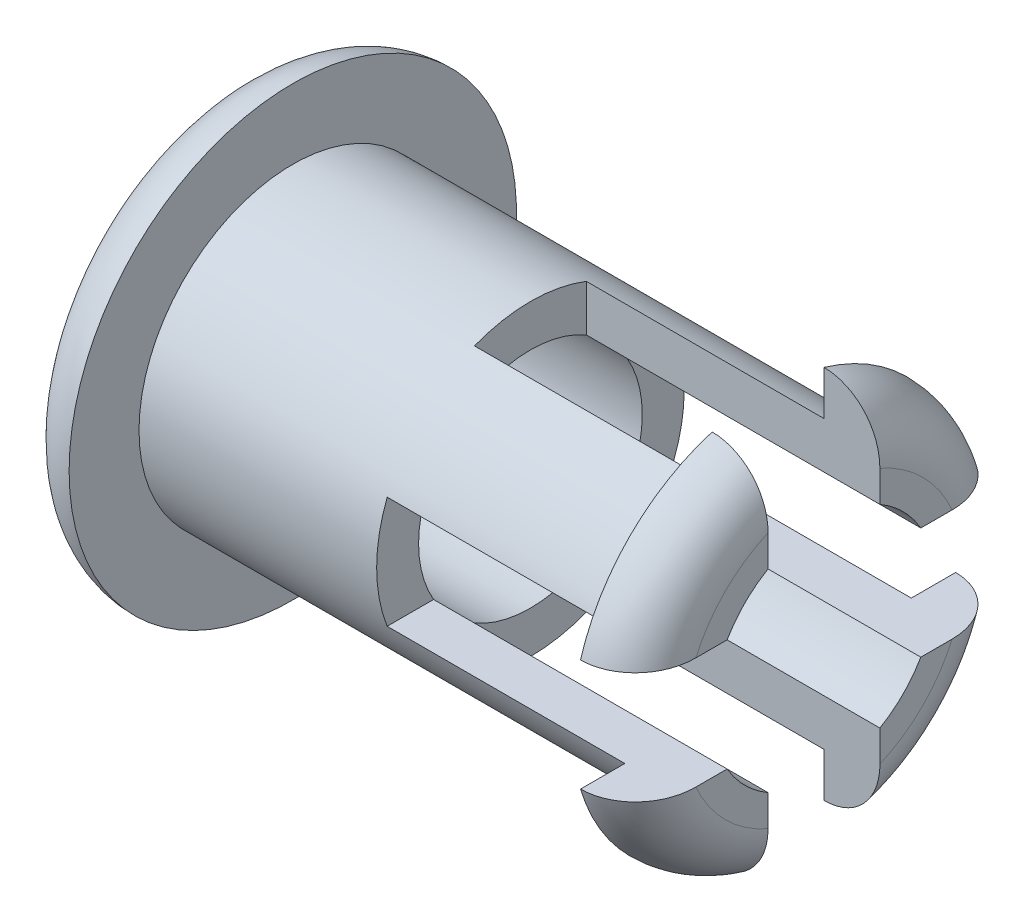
ISO-10303-21;
HEADER;
FILE_DESCRIPTION(('STEP AP214'),'2;1');
FILE_NAME('part.step','',(''),(''),'','','');
FILE_SCHEMA(('AUTOMOTIVE_DESIGN { 1 0 10303 214 1 1 1 1 }'));
ENDSEC;
DATA;
#1=APPLICATION_CONTEXT('core data for automotive mechanical design processes');
#2=APPLICATION_PROTOCOL_DEFINITION('international standard','automotive_design',2000,#1);
#3=PRODUCT_CONTEXT('',#1,'mechanical');
#4=PRODUCT('Part','Part','',(#3));
#5=PRODUCT_RELATED_PRODUCT_CATEGORY('part','',(#4));
#6=PRODUCT_DEFINITION_FORMATION('','',#4);
#7=PRODUCT_DEFINITION_CONTEXT('part definition',#1,'design');
#8=PRODUCT_DEFINITION('design','',#6,#7);
#9=PRODUCT_DEFINITION_SHAPE('','',#8);
#10=(LENGTH_UNIT() NAMED_UNIT(*) SI_UNIT(.MILLI.,.METRE.));
#11=(NAMED_UNIT(*) PLANE_ANGLE_UNIT() SI_UNIT($,.RADIAN.));
#12=(NAMED_UNIT(*) SI_UNIT($,.STERADIAN.) SOLID_ANGLE_UNIT());
#13=UNCERTAINTY_MEASURE_WITH_UNIT(LENGTH_MEASURE(1.E-05),#10,'distance_accuracy_value','');
#14=(GEOMETRIC_REPRESENTATION_CONTEXT(3) GLOBAL_UNCERTAINTY_ASSIGNED_CONTEXT((#13)) GLOBAL_UNIT_ASSIGNED_CONTEXT((#10,
#11,#12)) REPRESENTATION_CONTEXT('',''));
#15=CARTESIAN_POINT('',(0.,0.,0.));
#16=DIRECTION('',(0.,0.,1.));
#17=DIRECTION('',(1.,0.,0.));
#18=AXIS2_PLACEMENT_3D('',#15,#16,#17);
#19=CARTESIAN_POINT('',(16.66875,0.,0.));
#20=DIRECTION('',(1.,0.,0.));
#21=DIRECTION('',(0.,0.,-1.));
#22=AXIS2_PLACEMENT_3D('',#19,#20,#21);
#23=PLANE('',#22);
#24=DIRECTION('',(0.,0.,1.));
#25=VECTOR('',#24,1.);
#26=CARTESIAN_POINT('',(16.66875,3.175,-12.7));
#27=LINE('',#26,#25);
#28=CARTESIAN_POINT('',(16.66875,3.175,-7.2748389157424));
#29=VERTEX_POINT('',#28);
#30=CARTESIAN_POINT('',(16.66875,3.175,-5.49926131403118));
#31=VERTEX_POINT('',#30);
#32=EDGE_CURVE('E396',#29,#31,#27,.T.);
#33=ORIENTED_EDGE('',*,*,#32,.F.);
#34=CARTESIAN_POINT('',(16.66875,0.,0.));
#35=DIRECTION('',(1.,0.,0.));
#36=DIRECTION('',(0.,0.,-1.));
#37=AXIS2_PLACEMENT_3D('',#34,#35,#36);
#38=CIRCLE('',#37,7.9375);
#39=CARTESIAN_POINT('',(16.66875,7.2748389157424,-3.175));
#40=VERTEX_POINT('',#39);
#41=EDGE_CURVE('E367',#29,#40,#38,.T.);
#42=ORIENTED_EDGE('',*,*,#41,.T.);
#43=DIRECTION('',(0.,1.,0.));
#44=VECTOR('',#43,1.);
#45=CARTESIAN_POINT('',(16.66875,-12.7,-3.175));
#46=LINE('',#45,#44);
#47=CARTESIAN_POINT('',(16.66875,5.49926131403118,-3.175));
#48=VERTEX_POINT('',#47);
#49=EDGE_CURVE('E208',#48,#40,#46,.T.);
#50=ORIENTED_EDGE('',*,*,#49,.F.);
#51=CARTESIAN_POINT('',(16.66875,0.,0.));
#52=DIRECTION('',(-1.,0.,0.));
#53=DIRECTION('',(0.,0.,1.));
#54=AXIS2_PLACEMENT_3D('',#51,#52,#53);
#55=CIRCLE('',#54,6.35);
#56=EDGE_CURVE('E231',#48,#31,#55,.T.);
#57=ORIENTED_EDGE('',*,*,#56,.T.);
#58=EDGE_LOOP('',(#33,#42,#50,#57));
#59=FACE_BOUND('',#58,.T.);
#60=ADVANCED_FACE('F33',(#59),#23,.T.);
#61=CARTESIAN_POINT('',(13.49375,0.,0.));
#62=DIRECTION('',(1.,0.,0.));
#63=DIRECTION('',(0.,0.,-1.));
#64=AXIS2_PLACEMENT_3D('',#61,#62,#63);
#65=PLANE('',#64);
#66=CARTESIAN_POINT('',(13.49375,0.,0.));
#67=DIRECTION('',(1.,0.,0.));
#68=DIRECTION('',(0.,0.,-1.));
#69=AXIS2_PLACEMENT_3D('',#66,#67,#68);
#70=CIRCLE('',#69,8.73125);
#71=CARTESIAN_POINT('',(13.49375,3.175,-8.13351717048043));
#72=VERTEX_POINT('',#71);
#73=CARTESIAN_POINT('',(13.49375,8.13351717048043,-3.175));
#74=VERTEX_POINT('',#73);
#75=EDGE_CURVE('E269',#72,#74,#70,.T.);
#76=ORIENTED_EDGE('',*,*,#75,.T.);
#77=DIRECTION('',(0.,1.,0.));
#78=VECTOR('',#77,1.);
#79=CARTESIAN_POINT('',(13.49375,0.,-3.175));
#80=LINE('',#79,#78);
#81=CARTESIAN_POINT('',(13.49375,10.6492737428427,-3.175));
#82=VERTEX_POINT('',#81);
#83=EDGE_CURVE('E375',#74,#82,#80,.T.);
#84=ORIENTED_EDGE('',*,*,#83,.T.);
#85=CARTESIAN_POINT('',(13.49375,0.,0.));
#86=DIRECTION('',(1.,0.,0.));
#87=DIRECTION('',(0.,0.,-1.));
#88=AXIS2_PLACEMENT_3D('',#85,#86,#87);
#89=CIRCLE('',#88,11.1125);
#90=CARTESIAN_POINT('',(13.49375,3.175,-10.6492737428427));
#91=VERTEX_POINT('',#90);
#92=EDGE_CURVE('E253',#91,#82,#89,.T.);
#93=ORIENTED_EDGE('',*,*,#92,.F.);
#94=DIRECTION('',(0.,0.,1.));
#95=VECTOR('',#94,1.);
#96=CARTESIAN_POINT('',(13.49375,3.175,0.));
#97=LINE('',#96,#95);
#98=EDGE_CURVE('E421',#91,#72,#97,.T.);
#99=ORIENTED_EDGE('',*,*,#98,.T.);
#100=EDGE_LOOP('',(#76,#84,#93,#99));
#101=FACE_BOUND('',#100,.T.);
#102=ADVANCED_FACE('F379',(#101),#65,.F.);
#103=CARTESIAN_POINT('',(16.66875,-7.2748389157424,-3.175));
#104=VERTEX_POINT('',#103);
#105=CARTESIAN_POINT('',(16.66875,-5.49926131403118,-3.175));
#106=VERTEX_POINT('',#105);
#107=EDGE_CURVE('E500',#104,#106,#46,.T.);
#108=ORIENTED_EDGE('',*,*,#107,.F.);
#109=CARTESIAN_POINT('',(16.66875,0.,0.));
#110=DIRECTION('',(1.,0.,0.));
#111=DIRECTION('',(0.,0.,-1.));
#112=AXIS2_PLACEMENT_3D('',#109,#110,#111);
#113=CIRCLE('',#112,7.9375);
#114=CARTESIAN_POINT('',(16.66875,-3.175,-7.2748389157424));
#115=VERTEX_POINT('',#114);
#116=EDGE_CURVE('E340',#104,#115,#113,.T.);
#117=ORIENTED_EDGE('',*,*,#116,.T.);
#118=DIRECTION('',(0.,0.,1.));
#119=VECTOR('',#118,1.);
#120=CARTESIAN_POINT('',(16.66875,-3.175,-12.7));
#121=LINE('',#120,#119);
#122=CARTESIAN_POINT('',(16.66875,-3.175,-5.49926131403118));
#123=VERTEX_POINT('',#122);
#124=EDGE_CURVE('E400',#115,#123,#121,.T.);
#125=ORIENTED_EDGE('',*,*,#124,.T.);
#126=EDGE_CURVE('E228',#123,#106,#55,.T.);
#127=ORIENTED_EDGE('',*,*,#126,.T.);
#128=EDGE_LOOP('',(#108,#117,#125,#127));
#129=FACE_BOUND('',#128,.T.);
#130=ADVANCED_FACE('F498',(#129),#23,.T.);
#131=CARTESIAN_POINT('',(13.49375,-10.6492737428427,-3.175));
#132=VERTEX_POINT('',#131);
#133=CARTESIAN_POINT('',(13.49375,-3.175,-10.6492737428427));
#134=VERTEX_POINT('',#133);
#135=EDGE_CURVE('E240',#132,#134,#89,.T.);
#136=ORIENTED_EDGE('',*,*,#135,.F.);
#137=DIRECTION('',(0.,1.,0.));
#138=VECTOR('',#137,1.);
#139=CARTESIAN_POINT('',(13.49375,0.,-3.175));
#140=LINE('',#139,#138);
#141=CARTESIAN_POINT('',(13.49375,-8.13351717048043,-3.175));
#142=VERTEX_POINT('',#141);
#143=EDGE_CURVE('E450',#132,#142,#140,.T.);
#144=ORIENTED_EDGE('',*,*,#143,.T.);
#145=CARTESIAN_POINT('',(13.49375,-3.175,-8.13351717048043));
#146=VERTEX_POINT('',#145);
#147=EDGE_CURVE('E266',#142,#146,#70,.T.);
#148=ORIENTED_EDGE('',*,*,#147,.T.);
#149=DIRECTION('',(0.,0.,-1.));
#150=VECTOR('',#149,1.);
#151=CARTESIAN_POINT('',(13.49375,-3.175,0.));
#152=LINE('',#151,#150);
#153=EDGE_CURVE('E407',#146,#134,#152,.T.);
#154=ORIENTED_EDGE('',*,*,#153,.T.);
#155=EDGE_LOOP('',(#136,#144,#148,#154));
#156=FACE_BOUND('',#155,.T.);
#157=ADVANCED_FACE('F448',(#156),#65,.F.);
#158=DIRECTION('',(0.,1.,0.));
#159=VECTOR('',#158,1.);
#160=CARTESIAN_POINT('',(16.66875,-12.7,3.175));
#161=LINE('',#160,#159);
#162=CARTESIAN_POINT('',(16.66875,5.49926131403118,3.175));
#163=VERTEX_POINT('',#162);
#164=CARTESIAN_POINT('',(16.66875,7.2748389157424,3.175));
#165=VERTEX_POINT('',#164);
#166=EDGE_CURVE('E209',#163,#165,#161,.T.);
#167=ORIENTED_EDGE('',*,*,#166,.T.);
#168=CARTESIAN_POINT('',(16.66875,0.,0.));
#169=DIRECTION('',(1.,0.,0.));
#170=DIRECTION('',(0.,0.,-1.));
#171=AXIS2_PLACEMENT_3D('',#168,#169,#170);
#172=CIRCLE('',#171,7.9375);
#173=CARTESIAN_POINT('',(16.66875,3.175,7.2748389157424));
#174=VERTEX_POINT('',#173);
#175=EDGE_CURVE('E465',#165,#174,#172,.T.);
#176=ORIENTED_EDGE('',*,*,#175,.T.);
#177=CARTESIAN_POINT('',(16.66875,3.175,5.49926131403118));
#178=VERTEX_POINT('',#177);
#179=EDGE_CURVE('E397',#178,#174,#27,.T.);
#180=ORIENTED_EDGE('',*,*,#179,.F.);
#181=EDGE_CURVE('E232',#178,#163,#55,.T.);
#182=ORIENTED_EDGE('',*,*,#181,.T.);
#183=EDGE_LOOP('',(#167,#176,#180,#182));
#184=FACE_BOUND('',#183,.T.);
#185=ADVANCED_FACE('F509',(#184),#23,.T.);
#186=CARTESIAN_POINT('',(13.49375,10.6492737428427,3.175));
#187=VERTEX_POINT('',#186);
#188=CARTESIAN_POINT('',(13.49375,3.175,10.6492737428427));
#189=VERTEX_POINT('',#188);
#190=EDGE_CURVE('E248',#187,#189,#89,.T.);
#191=ORIENTED_EDGE('',*,*,#190,.F.);
#192=DIRECTION('',(0.,-1.,0.));
#193=VECTOR('',#192,1.);
#194=CARTESIAN_POINT('',(13.49375,0.,3.175));
#195=LINE('',#194,#193);
#196=CARTESIAN_POINT('',(13.49375,8.13351717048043,3.175));
#197=VERTEX_POINT('',#196);
#198=EDGE_CURVE('E458',#187,#197,#195,.T.);
#199=ORIENTED_EDGE('',*,*,#198,.T.);
#200=CARTESIAN_POINT('',(13.49375,3.175,8.13351717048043));
#201=VERTEX_POINT('',#200);
#202=EDGE_CURVE('E272',#197,#201,#70,.T.);
#203=ORIENTED_EDGE('',*,*,#202,.T.);
#204=EDGE_CURVE('E417',#201,#189,#97,.T.);
#205=ORIENTED_EDGE('',*,*,#204,.T.);
#206=EDGE_LOOP('',(#191,#199,#203,#205));
#207=FACE_BOUND('',#206,.T.);
#208=ADVANCED_FACE('F457',(#207),#65,.F.);
#209=CARTESIAN_POINT('',(13.49375,0.,0.));
#210=DIRECTION('',(-1.,0.,0.));
#211=DIRECTION('',(0.,0.,1.));
#212=AXIS2_PLACEMENT_3D('',#209,#210,#211);
#213=CYLINDRICAL_SURFACE('',#212,8.73125);
#214=CARTESIAN_POINT('',(0.,0.,0.));
#215=DIRECTION('',(-1.,0.,0.));
#216=DIRECTION('',(0.,0.,1.));
#217=AXIS2_PLACEMENT_3D('',#214,#215,#216);
#218=CIRCLE('',#217,8.73125);
#219=CARTESIAN_POINT('',(0.,8.13351717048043,3.175));
#220=VERTEX_POINT('',#219);
#221=CARTESIAN_POINT('',(0.,8.13351717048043,-3.175));
#222=VERTEX_POINT('',#221);
#223=EDGE_CURVE('E386',#220,#222,#218,.T.);
#224=ORIENTED_EDGE('',*,*,#223,.T.);
#225=DIRECTION('',(-1.,0.,0.));
#226=VECTOR('',#225,1.);
#227=CARTESIAN_POINT('',(13.49375,8.13351717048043,-3.175));
#228=LINE('',#227,#226);
#229=EDGE_CURVE('E383',#222,#74,#228,.F.);
#230=ORIENTED_EDGE('',*,*,#229,.T.);
#231=ORIENTED_EDGE('',*,*,#75,.F.);
#232=DIRECTION('',(-1.,0.,0.));
#233=VECTOR('',#232,1.);
#234=CARTESIAN_POINT('',(13.49375,3.175,-8.13351717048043));
#235=LINE('',#234,#233);
#236=CARTESIAN_POINT('',(0.,3.175,-8.13351717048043));
#237=VERTEX_POINT('',#236);
#238=EDGE_CURVE('E424',#72,#237,#235,.T.);
#239=ORIENTED_EDGE('',*,*,#238,.T.);
#240=CARTESIAN_POINT('',(0.,0.,0.));
#241=DIRECTION('',(-1.,0.,0.));
#242=DIRECTION('',(0.,0.,1.));
#243=AXIS2_PLACEMENT_3D('',#240,#241,#242);
#244=CIRCLE('',#243,8.73125);
#245=CARTESIAN_POINT('',(0.,-3.175,-8.13351717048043));
#246=VERTEX_POINT('',#245);
#247=EDGE_CURVE('E235',#237,#246,#244,.T.);
#248=ORIENTED_EDGE('',*,*,#247,.T.);
#249=DIRECTION('',(-1.,0.,0.));
#250=VECTOR('',#249,1.);
#251=CARTESIAN_POINT('',(13.49375,-3.175,-8.13351717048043));
#252=LINE('',#251,#250);
#253=EDGE_CURVE('E410',#246,#146,#252,.F.);
#254=ORIENTED_EDGE('',*,*,#253,.T.);
#255=ORIENTED_EDGE('',*,*,#147,.F.);
#256=DIRECTION('',(-1.,0.,0.));
#257=VECTOR('',#256,1.);
#258=CARTESIAN_POINT('',(13.49375,-8.13351717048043,-3.175));
#259=LINE('',#258,#257);
#260=CARTESIAN_POINT('',(0.,-8.13351717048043,-3.175));
#261=VERTEX_POINT('',#260);
#262=EDGE_CURVE('E388',#142,#261,#259,.T.);
#263=ORIENTED_EDGE('',*,*,#262,.T.);
#264=CARTESIAN_POINT('',(0.,-8.13351717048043,3.175));
#265=VERTEX_POINT('',#264);
#266=EDGE_CURVE('E382',#261,#265,#218,.T.);
#267=ORIENTED_EDGE('',*,*,#266,.T.);
#268=DIRECTION('',(-1.,0.,0.));
#269=VECTOR('',#268,1.);
#270=CARTESIAN_POINT('',(13.49375,-8.13351717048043,3.175));
#271=LINE('',#270,#269);
#272=CARTESIAN_POINT('',(13.49375,-8.13351717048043,3.175));
#273=VERTEX_POINT('',#272);
#274=EDGE_CURVE('E478',#265,#273,#271,.F.);
#275=ORIENTED_EDGE('',*,*,#274,.T.);
#276=CARTESIAN_POINT('',(13.49375,-3.175,8.13351717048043));
#277=VERTEX_POINT('',#276);
#278=EDGE_CURVE('E273',#277,#273,#70,.T.);
#279=ORIENTED_EDGE('',*,*,#278,.F.);
#280=DIRECTION('',(-1.,0.,0.));
#281=VECTOR('',#280,1.);
#282=CARTESIAN_POINT('',(13.49375,-3.175,8.13351717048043));
#283=LINE('',#282,#281);
#284=CARTESIAN_POINT('',(0.,-3.175,8.13351717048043));
#285=VERTEX_POINT('',#284);
#286=EDGE_CURVE('E414',#277,#285,#283,.T.);
#287=ORIENTED_EDGE('',*,*,#286,.T.);
#288=CARTESIAN_POINT('',(0.,3.175,8.13351717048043));
#289=VERTEX_POINT('',#288);
#290=EDGE_CURVE('E426',#285,#289,#244,.T.);
#291=ORIENTED_EDGE('',*,*,#290,.T.);
#292=DIRECTION('',(-1.,0.,0.));
#293=VECTOR('',#292,1.);
#294=CARTESIAN_POINT('',(13.49375,3.175,8.13351717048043));
#295=LINE('',#294,#293);
#296=EDGE_CURVE('E420',#289,#201,#295,.F.);
#297=ORIENTED_EDGE('',*,*,#296,.T.);
#298=ORIENTED_EDGE('',*,*,#202,.F.);
#299=DIRECTION('',(-1.,0.,0.));
#300=VECTOR('',#299,1.);
#301=CARTESIAN_POINT('',(13.49375,8.13351717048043,3.175));
#302=LINE('',#301,#300);
#303=EDGE_CURVE('E481',#197,#220,#302,.T.);
#304=ORIENTED_EDGE('',*,*,#303,.T.);
#305=EDGE_LOOP('',(#224,#230,#231,#239,#248,#254,#255,#263,#267,#275,#279,#287,#291,#297,#298,#304));
#306=FACE_BOUND('',#305,.T.);
#307=CARTESIAN_POINT('',(-13.49375,0.,0.));
#308=DIRECTION('',(1.,0.,0.));
#309=DIRECTION('',(0.,0.,-1.));
#310=AXIS2_PLACEMENT_3D('',#307,#308,#309);
#311=CIRCLE('',#310,8.73125);
#312=CARTESIAN_POINT('',(-13.49375,0.,-8.73125));
#313=VERTEX_POINT('',#312);
#314=EDGE_CURVE('E262',#313,#313,#311,.T.);
#315=ORIENTED_EDGE('',*,*,#314,.T.);
#316=EDGE_LOOP('',(#315));
#317=FACE_BOUND('',#316,.T.);
#318=ADVANCED_FACE('F431',(#306,#317),#213,.T.);
#319=CARTESIAN_POINT('',(-16.66875,0.,0.));
#320=DIRECTION('',(-1.,0.,0.));
#321=DIRECTION('',(0.,0.,1.));
#322=AXIS2_PLACEMENT_3D('',#319,#320,#321);
#323=PLANE('',#322);
#324=CARTESIAN_POINT('',(-16.66875,0.,0.));
#325=DIRECTION('',(-1.,0.,0.));
#326=DIRECTION('',(0.,0.,1.));
#327=AXIS2_PLACEMENT_3D('',#324,#325,#326);
#328=CIRCLE('',#327,9.525);
#329=CARTESIAN_POINT('',(-16.66875,0.,9.525));
#330=VERTEX_POINT('',#329);
#331=EDGE_CURVE('E298',#330,#330,#328,.T.);
#332=ORIENTED_EDGE('',*,*,#331,.T.);
#333=EDGE_LOOP('',(#332));
#334=FACE_BOUND('',#333,.T.);
#335=CARTESIAN_POINT('',(-16.66875,0.,0.));
#336=DIRECTION('',(-1.,0.,0.));
#337=DIRECTION('',(0.,0.,1.));
#338=AXIS2_PLACEMENT_3D('',#335,#336,#337);
#339=CIRCLE('',#338,6.35);
#340=CARTESIAN_POINT('',(-16.66875,0.,6.35));
#341=VERTEX_POINT('',#340);
#342=EDGE_CURVE('E229',#341,#341,#339,.T.);
#343=ORIENTED_EDGE('',*,*,#342,.F.);
#344=EDGE_LOOP('',(#343));
#345=FACE_BOUND('',#344,.T.);
#346=ADVANCED_FACE('F631',(#334,#345),#323,.T.);
#347=CARTESIAN_POINT('',(-13.49375,0.,0.));
#348=DIRECTION('',(-1.,0.,0.));
#349=DIRECTION('',(0.,0.,1.));
#350=AXIS2_PLACEMENT_3D('',#347,#348,#349);
#351=PLANE('',#350);
#352=ORIENTED_EDGE('',*,*,#314,.F.);
#353=EDGE_LOOP('',(#352));
#354=FACE_BOUND('',#353,.T.);
#355=CARTESIAN_POINT('',(-13.49375,0.,0.));
#356=DIRECTION('',(-1.,0.,0.));
#357=DIRECTION('',(0.,0.,1.));
#358=AXIS2_PLACEMENT_3D('',#355,#356,#357);
#359=CIRCLE('',#358,12.7);
#360=CARTESIAN_POINT('',(-13.49375,0.,12.7));
#361=VERTEX_POINT('',#360);
#362=EDGE_CURVE('E259',#361,#361,#359,.T.);
#363=ORIENTED_EDGE('',*,*,#362,.F.);
#364=EDGE_LOOP('',(#363));
#365=FACE_BOUND('',#364,.T.);
#366=ADVANCED_FACE('F519',(#354,#365),#351,.F.);
#367=CARTESIAN_POINT('',(16.66875,-3.175,5.49926131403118));
#368=VERTEX_POINT('',#367);
#369=CARTESIAN_POINT('',(16.66875,-3.175,7.2748389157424));
#370=VERTEX_POINT('',#369);
#371=EDGE_CURVE('E401',#368,#370,#121,.T.);
#372=ORIENTED_EDGE('',*,*,#371,.T.);
#373=CARTESIAN_POINT('',(16.66875,0.,0.));
#374=DIRECTION('',(1.,0.,0.));
#375=DIRECTION('',(0.,0.,-1.));
#376=AXIS2_PLACEMENT_3D('',#373,#374,#375);
#377=CIRCLE('',#376,7.9375);
#378=CARTESIAN_POINT('',(16.66875,-7.2748389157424,3.175));
#379=VERTEX_POINT('',#378);
#380=EDGE_CURVE('E206',#370,#379,#377,.T.);
#381=ORIENTED_EDGE('',*,*,#380,.T.);
#382=CARTESIAN_POINT('',(16.66875,-5.49926131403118,3.175));
#383=VERTEX_POINT('',#382);
#384=EDGE_CURVE('E198',#379,#383,#161,.T.);
#385=ORIENTED_EDGE('',*,*,#384,.T.);
#386=EDGE_CURVE('E203',#383,#368,#55,.T.);
#387=ORIENTED_EDGE('',*,*,#386,.T.);
#388=EDGE_LOOP('',(#372,#381,#385,#387));
#389=FACE_BOUND('',#388,.T.);
#390=ADVANCED_FACE('F201',(#389),#23,.T.);
#391=ORIENTED_EDGE('',*,*,#278,.T.);
#392=DIRECTION('',(0.,-1.,0.));
#393=VECTOR('',#392,1.);
#394=CARTESIAN_POINT('',(13.49375,0.,3.175));
#395=LINE('',#394,#393);
#396=CARTESIAN_POINT('',(13.49375,-10.6492737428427,3.175));
#397=VERTEX_POINT('',#396);
#398=EDGE_CURVE('E473',#273,#397,#395,.T.);
#399=ORIENTED_EDGE('',*,*,#398,.T.);
#400=CARTESIAN_POINT('',(13.49375,-3.175,10.6492737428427));
#401=VERTEX_POINT('',#400);
#402=EDGE_CURVE('E246',#401,#397,#89,.T.);
#403=ORIENTED_EDGE('',*,*,#402,.F.);
#404=EDGE_CURVE('E411',#401,#277,#152,.T.);
#405=ORIENTED_EDGE('',*,*,#404,.T.);
#406=EDGE_LOOP('',(#391,#399,#403,#405));
#407=FACE_BOUND('',#406,.T.);
#408=ADVANCED_FACE('F476',(#407),#65,.F.);
#409=CARTESIAN_POINT('',(16.66875,0.,0.));
#410=DIRECTION('',(-1.,0.,0.));
#411=DIRECTION('',(0.,0.,1.));
#412=AXIS2_PLACEMENT_3D('',#409,#410,#411);
#413=CYLINDRICAL_SURFACE('',#412,6.35);
#414=ORIENTED_EDGE('',*,*,#56,.F.);
#415=DIRECTION('',(-1.,0.,0.));
#416=VECTOR('',#415,1.);
#417=CARTESIAN_POINT('',(16.66875,5.49926131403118,-3.175));
#418=LINE('',#417,#416);
#419=CARTESIAN_POINT('',(0.,5.49926131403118,-3.175));
#420=VERTEX_POINT('',#419);
#421=EDGE_CURVE('E295',#48,#420,#418,.T.);
#422=ORIENTED_EDGE('',*,*,#421,.T.);
#423=CARTESIAN_POINT('',(0.,0.,0.));
#424=DIRECTION('',(-1.,0.,0.));
#425=DIRECTION('',(0.,0.,1.));
#426=AXIS2_PLACEMENT_3D('',#423,#424,#425);
#427=CIRCLE('',#426,6.35);
#428=CARTESIAN_POINT('',(0.,5.49926131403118,3.175));
#429=VERTEX_POINT('',#428);
#430=EDGE_CURVE('E289',#420,#429,#427,.F.);
#431=ORIENTED_EDGE('',*,*,#430,.T.);
#432=DIRECTION('',(-1.,0.,0.));
#433=VECTOR('',#432,1.);
#434=CARTESIAN_POINT('',(16.66875,5.49926131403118,3.175));
#435=LINE('',#434,#433);
#436=EDGE_CURVE('E292',#429,#163,#435,.F.);
#437=ORIENTED_EDGE('',*,*,#436,.T.);
#438=ORIENTED_EDGE('',*,*,#181,.F.);
#439=DIRECTION('',(-1.,0.,0.));
#440=VECTOR('',#439,1.);
#441=CARTESIAN_POINT('',(16.66875,3.175,5.49926131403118));
#442=LINE('',#441,#440);
#443=CARTESIAN_POINT('',(0.,3.175,5.49926131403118));
#444=VERTEX_POINT('',#443);
#445=EDGE_CURVE('E220',#178,#444,#442,.T.);
#446=ORIENTED_EDGE('',*,*,#445,.T.);
#447=CARTESIAN_POINT('',(0.,0.,0.));
#448=DIRECTION('',(-1.,0.,0.));
#449=DIRECTION('',(0.,0.,1.));
#450=AXIS2_PLACEMENT_3D('',#447,#448,#449);
#451=CIRCLE('',#450,6.35);
#452=CARTESIAN_POINT('',(0.,-3.175,5.49926131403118));
#453=VERTEX_POINT('',#452);
#454=EDGE_CURVE('E281',#444,#453,#451,.F.);
#455=ORIENTED_EDGE('',*,*,#454,.T.);
#456=DIRECTION('',(-1.,0.,0.));
#457=VECTOR('',#456,1.);
#458=CARTESIAN_POINT('',(16.66875,-3.175,5.49926131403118));
#459=LINE('',#458,#457);
#460=EDGE_CURVE('E227',#453,#368,#459,.F.);
#461=ORIENTED_EDGE('',*,*,#460,.T.);
#462=ORIENTED_EDGE('',*,*,#386,.F.);
#463=DIRECTION('',(-1.,0.,0.));
#464=VECTOR('',#463,1.);
#465=CARTESIAN_POINT('',(16.66875,-5.49926131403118,3.175));
#466=LINE('',#465,#464);
#467=CARTESIAN_POINT('',(0.,-5.49926131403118,3.175));
#468=VERTEX_POINT('',#467);
#469=EDGE_CURVE('E212',#383,#468,#466,.T.);
#470=ORIENTED_EDGE('',*,*,#469,.T.);
#471=CARTESIAN_POINT('',(0.,-5.49926131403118,-3.175));
#472=VERTEX_POINT('',#471);
#473=EDGE_CURVE('E219',#468,#472,#427,.F.);
#474=ORIENTED_EDGE('',*,*,#473,.T.);
#475=DIRECTION('',(-1.,0.,0.));
#476=VECTOR('',#475,1.);
#477=CARTESIAN_POINT('',(16.66875,-5.49926131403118,-3.175));
#478=LINE('',#477,#476);
#479=EDGE_CURVE('E288',#472,#106,#478,.F.);
#480=ORIENTED_EDGE('',*,*,#479,.T.);
#481=ORIENTED_EDGE('',*,*,#126,.F.);
#482=DIRECTION('',(-1.,0.,0.));
#483=VECTOR('',#482,1.);
#484=CARTESIAN_POINT('',(16.66875,-3.175,-5.49926131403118));
#485=LINE('',#484,#483);
#486=CARTESIAN_POINT('',(0.,-3.175,-5.49926131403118));
#487=VERTEX_POINT('',#486);
#488=EDGE_CURVE('E271',#123,#487,#485,.T.);
#489=ORIENTED_EDGE('',*,*,#488,.T.);
#490=CARTESIAN_POINT('',(0.,3.175,-5.49926131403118));
#491=VERTEX_POINT('',#490);
#492=EDGE_CURVE('E277',#487,#491,#451,.F.);
#493=ORIENTED_EDGE('',*,*,#492,.T.);
#494=DIRECTION('',(-1.,0.,0.));
#495=VECTOR('',#494,1.);
#496=CARTESIAN_POINT('',(16.66875,3.175,-5.49926131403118));
#497=LINE('',#496,#495);
#498=EDGE_CURVE('E280',#491,#31,#497,.F.);
#499=ORIENTED_EDGE('',*,*,#498,.T.);
#500=EDGE_LOOP('',(#414,#422,#431,#437,#438,#446,#455,#461,#462,#470,#474,#480,#481,#489,#493,#499));
#501=FACE_BOUND('',#500,.T.);
#502=ORIENTED_EDGE('',*,*,#342,.T.);
#503=EDGE_LOOP('',(#502));
#504=FACE_BOUND('',#503,.T.);
#505=ADVANCED_FACE('F224',(#501,#504),#413,.F.);
#506=CARTESIAN_POINT('',(0.,-3.175,-12.7));
#507=DIRECTION('',(0.,-1.,0.));
#508=DIRECTION('',(0.,0.,-1.));
#509=AXIS2_PLACEMENT_3D('',#506,#507,#508);
#510=PLANE('',#509);
#511=ORIENTED_EDGE('',*,*,#124,.F.);
#512=CARTESIAN_POINT('',(16.66875,-3.175,-7.2748389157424));
#513=CARTESIAN_POINT('',(16.6687580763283,-3.175,-7.37528936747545));
#514=CARTESIAN_POINT('',(16.6647453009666,-3.175,-7.47574969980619));
#515=CARTESIAN_POINT('',(16.6485756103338,-3.175,-7.67604548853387));
#516=CARTESIAN_POINT('',(16.6364158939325,-3.175,-7.77588071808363));
#517=CARTESIAN_POINT('',(16.6038111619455,-3.175,-7.97444656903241));
#518=CARTESIAN_POINT('',(16.5833465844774,-3.175,-8.07317401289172));
#519=CARTESIAN_POINT('',(16.5341350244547,-3.175,-8.26850249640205));
#520=CARTESIAN_POINT('',(16.5053890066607,-3.175,-8.36510378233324));
#521=CARTESIAN_POINT('',(16.4065794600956,-3.175,-8.65110184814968));
#522=CARTESIAN_POINT('',(16.3239966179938,-3.175,-8.83636975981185));
#523=CARTESIAN_POINT('',(16.1270885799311,-3.175,-9.18883653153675));
#524=CARTESIAN_POINT('',(16.012806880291,-3.175,-9.35605971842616));
#525=CARTESIAN_POINT('',(15.7629485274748,-3.175,-9.65735738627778));
#526=CARTESIAN_POINT('',(15.62903513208,-3.175,-9.79280901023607));
#527=CARTESIAN_POINT('',(15.3391187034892,-3.175,-10.0377326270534));
#528=CARTESIAN_POINT('',(15.1831115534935,-3.175,-10.1471997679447));
#529=CARTESIAN_POINT('',(14.8629943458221,-3.175,-10.3307051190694));
#530=CARTESIAN_POINT('',(14.6998160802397,-3.175,-10.4063738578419));
#531=CARTESIAN_POINT('',(14.3628737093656,-3.175,-10.5280899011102));
#532=CARTESIAN_POINT('',(14.1891241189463,-3.175,-10.5741768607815));
#533=CARTESIAN_POINT('',(13.9271030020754,-3.175,-10.6195252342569));
#534=CARTESIAN_POINT('',(13.8407401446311,-3.175,-10.6306793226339));
#535=CARTESIAN_POINT('',(13.6675160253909,-3.175,-10.6455474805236));
#536=CARTESIAN_POINT('',(13.5806557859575,-3.175,-10.6492734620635));
#537=CARTESIAN_POINT('',(13.49375,-3.175,-10.6492737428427));
#538=B_SPLINE_CURVE_WITH_KNOTS('',3,(#512,#513,#514,#515,#516,#517,#518,#519,#520,#521,#522,
#523,#524,#525,#526,#527,#528,#529,#530,#531,#532,#533,#534,#535,#536,#537),.UNSPECIFIED.,.F.,
.F.,(4,2,2,2,2,2,2,2,2,2,2,2,4),(0.,0.301284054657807,0.602671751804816,0.904773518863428,
1.20684010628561,1.81194223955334,2.41621814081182,2.98468481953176,3.55325756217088,
4.09024009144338,4.62650126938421,4.88746750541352,5.14801490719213),.UNSPECIFIED.);
#539=EDGE_CURVE('E355',#115,#134,#538,.T.);
#540=ORIENTED_EDGE('',*,*,#539,.T.);
#541=ORIENTED_EDGE('',*,*,#153,.F.);
#542=ORIENTED_EDGE('',*,*,#253,.F.);
#543=DIRECTION('',(0.,0.,1.));
#544=VECTOR('',#543,1.);
#545=CARTESIAN_POINT('',(0.,-3.175,-12.7));
#546=LINE('',#545,#544);
#547=EDGE_CURVE('E403',#246,#487,#546,.T.);
#548=ORIENTED_EDGE('',*,*,#547,.T.);
#549=ORIENTED_EDGE('',*,*,#488,.F.);
#550=EDGE_LOOP('',(#511,#540,#541,#542,#548,#549));
#551=FACE_BOUND('',#550,.T.);
#552=ADVANCED_FACE('F445',(#551),#510,.F.);
#553=CARTESIAN_POINT('',(0.,3.175,-12.7));
#554=DIRECTION('',(0.,1.,0.));
#555=DIRECTION('',(0.,0.,1.));
#556=AXIS2_PLACEMENT_3D('',#553,#554,#555);
#557=PLANE('',#556);
#558=ORIENTED_EDGE('',*,*,#98,.F.);
#559=CARTESIAN_POINT('',(13.49375,3.175,-10.6492737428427));
#560=CARTESIAN_POINT('',(13.5801126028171,3.175,-10.6492838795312));
#561=CARTESIAN_POINT('',(13.6664703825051,3.175,-10.6455968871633));
#562=CARTESIAN_POINT('',(13.8385522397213,3.175,-10.630906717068));
#563=CARTESIAN_POINT('',(13.9242763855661,3.175,-10.6199043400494));
#564=CARTESIAN_POINT('',(14.094341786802,3.175,-10.590686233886));
#565=CARTESIAN_POINT('',(14.1786851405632,3.175,-10.5724827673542));
#566=CARTESIAN_POINT('',(14.3455136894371,3.175,-10.5290340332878));
#567=CARTESIAN_POINT('',(14.4279988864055,3.175,-10.5037887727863));
#568=CARTESIAN_POINT('',(14.6718268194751,3.175,-10.4177578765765));
#569=CARTESIAN_POINT('',(14.8296646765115,3.175,-10.3466558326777));
#570=CARTESIAN_POINT('',(15.1312988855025,3.175,-10.1793487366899));
#571=CARTESIAN_POINT('',(15.2750938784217,3.175,-10.0831412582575));
#572=CARTESIAN_POINT('',(15.5470212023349,3.175,-9.86710329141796));
#573=CARTESIAN_POINT('',(15.674904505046,3.175,-9.74695927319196));
#574=CARTESIAN_POINT('',(15.9095781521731,3.175,-9.4876340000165));
#575=CARTESIAN_POINT('',(16.0163667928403,3.175,-9.34845120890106));
#576=CARTESIAN_POINT('',(16.2104311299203,3.175,-9.04932144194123));
#577=CARTESIAN_POINT('',(16.2967838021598,3.175,-8.88877650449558));
#578=CARTESIAN_POINT('',(16.4430036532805,3.175,-8.55599591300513));
#579=CARTESIAN_POINT('',(16.5028559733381,3.175,-8.38375376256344));
#580=CARTESIAN_POINT('',(16.5892823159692,3.175,-8.05573627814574));
#581=CARTESIAN_POINT('',(16.6192384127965,3.175,-7.90084285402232));
#582=CARTESIAN_POINT('',(16.6490348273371,3.175,-7.66684045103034));
#583=CARTESIAN_POINT('',(16.6564441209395,3.175,-7.58862739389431));
#584=CARTESIAN_POINT('',(16.6663015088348,3.175,-7.43189435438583));
#585=CARTESIAN_POINT('',(16.6687499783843,3.175,-7.35337439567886));
#586=CARTESIAN_POINT('',(16.66875,3.175,-7.2748389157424));
#587=B_SPLINE_CURVE_WITH_KNOTS('',3,(#559,#560,#561,#562,#563,#564,#565,#566,#567,#568,#569,
#570,#571,#572,#573,#574,#575,#576,#577,#578,#579,#580,#581,#582,#583,#584,#585,#586),
.UNSPECIFIED.,.F.,.F.,(4,2,2,2,2,2,2,2,2,2,2,2,2,4),(0.,0.259000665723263,0.517972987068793,
0.776506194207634,1.03503914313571,1.55173592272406,2.06848265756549,2.59250495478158,
3.11656955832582,3.66106503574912,4.2058654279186,4.67774183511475,4.91329420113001,
5.14882874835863),.UNSPECIFIED.);
#588=EDGE_CURVE('E11',#91,#29,#587,.T.);
#589=ORIENTED_EDGE('',*,*,#588,.T.);
#590=ORIENTED_EDGE('',*,*,#32,.T.);
#591=ORIENTED_EDGE('',*,*,#498,.F.);
#592=DIRECTION('',(0.,0.,1.));
#593=VECTOR('',#592,1.);
#594=CARTESIAN_POINT('',(0.,3.175,-12.7));
#595=LINE('',#594,#593);
#596=EDGE_CURVE('E395',#237,#491,#595,.T.);
#597=ORIENTED_EDGE('',*,*,#596,.F.);
#598=ORIENTED_EDGE('',*,*,#238,.F.);
#599=EDGE_LOOP('',(#558,#589,#590,#591,#597,#598));
#600=FACE_BOUND('',#599,.T.);
#601=ADVANCED_FACE('F440',(#600),#557,.F.);
#602=CARTESIAN_POINT('',(0.,3.175,-12.7));
#603=DIRECTION('',(-1.,0.,0.));
#604=DIRECTION('',(0.,0.,1.));
#605=AXIS2_PLACEMENT_3D('',#602,#603,#604);
#606=PLANE('',#605);
#607=ORIENTED_EDGE('',*,*,#596,.T.);
#608=ORIENTED_EDGE('',*,*,#492,.F.);
#609=ORIENTED_EDGE('',*,*,#547,.F.);
#610=ORIENTED_EDGE('',*,*,#247,.F.);
#611=EDGE_LOOP('',(#607,#608,#609,#610));
#612=FACE_BOUND('',#611,.T.);
#613=ADVANCED_FACE('F438',(#612),#606,.F.);
#614=EDGE_CURVE('E404',#453,#285,#546,.T.);
#615=ORIENTED_EDGE('',*,*,#614,.F.);
#616=ORIENTED_EDGE('',*,*,#454,.F.);
#617=EDGE_CURVE('E392',#444,#289,#595,.T.);
#618=ORIENTED_EDGE('',*,*,#617,.T.);
#619=ORIENTED_EDGE('',*,*,#290,.F.);
#620=EDGE_LOOP('',(#615,#616,#618,#619));
#621=FACE_BOUND('',#620,.T.);
#622=ADVANCED_FACE('F588',(#621),#606,.F.);
#623=ORIENTED_EDGE('',*,*,#179,.T.);
#624=CARTESIAN_POINT('',(16.66875,3.175,7.2748389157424));
#625=CARTESIAN_POINT('',(16.6687580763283,3.175,7.37528936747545));
#626=CARTESIAN_POINT('',(16.6647453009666,3.175,7.47574969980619));
#627=CARTESIAN_POINT('',(16.6485756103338,3.175,7.67604548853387));
#628=CARTESIAN_POINT('',(16.6364158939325,3.175,7.77588071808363));
#629=CARTESIAN_POINT('',(16.6038111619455,3.175,7.97444656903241));
#630=CARTESIAN_POINT('',(16.5833465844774,3.175,8.07317401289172));
#631=CARTESIAN_POINT('',(16.5341350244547,3.175,8.26850249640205));
#632=CARTESIAN_POINT('',(16.5053890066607,3.175,8.36510378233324));
#633=CARTESIAN_POINT('',(16.4065794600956,3.175,8.65110184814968));
#634=CARTESIAN_POINT('',(16.3239966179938,3.175,8.83636975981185));
#635=CARTESIAN_POINT('',(16.1270885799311,3.175,9.18883653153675));
#636=CARTESIAN_POINT('',(16.012806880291,3.175,9.35605971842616));
#637=CARTESIAN_POINT('',(15.7629485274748,3.175,9.65735738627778));
#638=CARTESIAN_POINT('',(15.62903513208,3.175,9.79280901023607));
#639=CARTESIAN_POINT('',(15.3391187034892,3.175,10.0377326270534));
#640=CARTESIAN_POINT('',(15.1831115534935,3.175,10.1471997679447));
#641=CARTESIAN_POINT('',(14.8629943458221,3.175,10.3307051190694));
#642=CARTESIAN_POINT('',(14.6998160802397,3.175,10.4063738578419));
#643=CARTESIAN_POINT('',(14.3628737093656,3.175,10.5280899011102));
#644=CARTESIAN_POINT('',(14.1891241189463,3.175,10.5741768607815));
#645=CARTESIAN_POINT('',(13.9271030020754,3.175,10.6195252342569));
#646=CARTESIAN_POINT('',(13.8407401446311,3.175,10.6306793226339));
#647=CARTESIAN_POINT('',(13.6675160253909,3.175,10.6455474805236));
#648=CARTESIAN_POINT('',(13.5806557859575,3.175,10.6492734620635));
#649=CARTESIAN_POINT('',(13.49375,3.175,10.6492737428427));
#650=B_SPLINE_CURVE_WITH_KNOTS('',3,(#624,#625,#626,#627,#628,#629,#630,#631,#632,#633,#634,
#635,#636,#637,#638,#639,#640,#641,#642,#643,#644,#645,#646,#647,#648,#649),.UNSPECIFIED.,.F.,
.F.,(4,2,2,2,2,2,2,2,2,2,2,2,4),(0.,0.301284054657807,0.602671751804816,0.904773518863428,
1.20684010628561,1.81194223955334,2.41621814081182,2.98468481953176,3.55325756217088,
4.09024009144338,4.62650126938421,4.88746750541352,5.14801490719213),.UNSPECIFIED.);
#651=EDGE_CURVE('E341',#174,#189,#650,.T.);
#652=ORIENTED_EDGE('',*,*,#651,.T.);
#653=ORIENTED_EDGE('',*,*,#204,.F.);
#654=ORIENTED_EDGE('',*,*,#296,.F.);
#655=ORIENTED_EDGE('',*,*,#617,.F.);
#656=ORIENTED_EDGE('',*,*,#445,.F.);
#657=EDGE_LOOP('',(#623,#652,#653,#654,#655,#656));
#658=FACE_BOUND('',#657,.T.);
#659=ADVANCED_FACE('F461',(#658),#557,.F.);
#660=ORIENTED_EDGE('',*,*,#404,.F.);
#661=CARTESIAN_POINT('',(13.49375,-3.175,10.6492737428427));
#662=CARTESIAN_POINT('',(13.5801126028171,-3.175,10.6492838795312));
#663=CARTESIAN_POINT('',(13.6664703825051,-3.175,10.6455968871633));
#664=CARTESIAN_POINT('',(13.8385522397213,-3.175,10.630906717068));
#665=CARTESIAN_POINT('',(13.9242763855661,-3.175,10.6199043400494));
#666=CARTESIAN_POINT('',(14.094341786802,-3.175,10.590686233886));
#667=CARTESIAN_POINT('',(14.1786851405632,-3.175,10.5724827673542));
#668=CARTESIAN_POINT('',(14.3455136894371,-3.175,10.5290340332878));
#669=CARTESIAN_POINT('',(14.4279988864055,-3.175,10.5037887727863));
#670=CARTESIAN_POINT('',(14.6718268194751,-3.175,10.4177578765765));
#671=CARTESIAN_POINT('',(14.8296646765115,-3.175,10.3466558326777));
#672=CARTESIAN_POINT('',(15.1312988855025,-3.175,10.1793487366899));
#673=CARTESIAN_POINT('',(15.2750938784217,-3.175,10.0831412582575));
#674=CARTESIAN_POINT('',(15.5470212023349,-3.175,9.86710329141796));
#675=CARTESIAN_POINT('',(15.674904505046,-3.175,9.74695927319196));
#676=CARTESIAN_POINT('',(15.9095781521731,-3.175,9.4876340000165));
#677=CARTESIAN_POINT('',(16.0163667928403,-3.175,9.34845120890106));
#678=CARTESIAN_POINT('',(16.2104311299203,-3.175,9.04932144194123));
#679=CARTESIAN_POINT('',(16.2967838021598,-3.175,8.88877650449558));
#680=CARTESIAN_POINT('',(16.4430036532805,-3.175,8.55599591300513));
#681=CARTESIAN_POINT('',(16.5028559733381,-3.175,8.38375376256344));
#682=CARTESIAN_POINT('',(16.5892823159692,-3.175,8.05573627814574));
#683=CARTESIAN_POINT('',(16.6192384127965,-3.175,7.90084285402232));
#684=CARTESIAN_POINT('',(16.6490348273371,-3.175,7.66684045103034));
#685=CARTESIAN_POINT('',(16.6564441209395,-3.175,7.58862739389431));
#686=CARTESIAN_POINT('',(16.6663015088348,-3.175,7.43189435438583));
#687=CARTESIAN_POINT('',(16.6687499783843,-3.175,7.35337439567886));
#688=CARTESIAN_POINT('',(16.66875,-3.175,7.2748389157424));
#689=B_SPLINE_CURVE_WITH_KNOTS('',3,(#661,#662,#663,#664,#665,#666,#667,#668,#669,#670,#671,
#672,#673,#674,#675,#676,#677,#678,#679,#680,#681,#682,#683,#684,#685,#686,#687,#688),
.UNSPECIFIED.,.F.,.F.,(4,2,2,2,2,2,2,2,2,2,2,2,2,4),(0.,0.259000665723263,0.517972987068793,
0.776506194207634,1.03503914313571,1.55173592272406,2.06848265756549,2.59250495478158,
3.11656955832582,3.66106503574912,4.2058654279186,4.67774183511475,4.91329420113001,
5.14882874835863),.UNSPECIFIED.);
#690=EDGE_CURVE('E310',#401,#370,#689,.T.);
#691=ORIENTED_EDGE('',*,*,#690,.T.);
#692=ORIENTED_EDGE('',*,*,#371,.F.);
#693=ORIENTED_EDGE('',*,*,#460,.F.);
#694=ORIENTED_EDGE('',*,*,#614,.T.);
#695=ORIENTED_EDGE('',*,*,#286,.F.);
#696=EDGE_LOOP('',(#660,#691,#692,#693,#694,#695));
#697=FACE_BOUND('',#696,.T.);
#698=ADVANCED_FACE('F468',(#697),#510,.F.);
#699=CARTESIAN_POINT('',(0.,-12.7,3.175));
#700=DIRECTION('',(0.,0.,1.));
#701=DIRECTION('',(1.,0.,0.));
#702=AXIS2_PLACEMENT_3D('',#699,#700,#701);
#703=PLANE('',#702);
#704=ORIENTED_EDGE('',*,*,#384,.F.);
#705=CARTESIAN_POINT('',(16.66875,-7.2748389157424,3.175));
#706=CARTESIAN_POINT('',(16.6687580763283,-7.37528936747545,3.175));
#707=CARTESIAN_POINT('',(16.6647453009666,-7.47574969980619,3.175));
#708=CARTESIAN_POINT('',(16.6485756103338,-7.67604548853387,3.175));
#709=CARTESIAN_POINT('',(16.6364158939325,-7.77588071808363,3.175));
#710=CARTESIAN_POINT('',(16.6038111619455,-7.97444656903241,3.175));
#711=CARTESIAN_POINT('',(16.5833465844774,-8.07317401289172,3.175));
#712=CARTESIAN_POINT('',(16.5341350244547,-8.26850249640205,3.175));
#713=CARTESIAN_POINT('',(16.5053890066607,-8.36510378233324,3.175));
#714=CARTESIAN_POINT('',(16.4065794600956,-8.65110184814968,3.175));
#715=CARTESIAN_POINT('',(16.3239966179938,-8.83636975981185,3.175));
#716=CARTESIAN_POINT('',(16.1270885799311,-9.18883653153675,3.175));
#717=CARTESIAN_POINT('',(16.012806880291,-9.35605971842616,3.175));
#718=CARTESIAN_POINT('',(15.7629485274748,-9.65735738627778,3.175));
#719=CARTESIAN_POINT('',(15.62903513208,-9.79280901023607,3.175));
#720=CARTESIAN_POINT('',(15.3391187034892,-10.0377326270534,3.175));
#721=CARTESIAN_POINT('',(15.1831115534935,-10.1471997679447,3.175));
#722=CARTESIAN_POINT('',(14.8629943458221,-10.3307051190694,3.175));
#723=CARTESIAN_POINT('',(14.6998160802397,-10.4063738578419,3.175));
#724=CARTESIAN_POINT('',(14.3628737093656,-10.5280899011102,3.175));
#725=CARTESIAN_POINT('',(14.1891241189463,-10.5741768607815,3.175));
#726=CARTESIAN_POINT('',(13.9271030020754,-10.6195252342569,3.175));
#727=CARTESIAN_POINT('',(13.8407401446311,-10.6306793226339,3.175));
#728=CARTESIAN_POINT('',(13.6675160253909,-10.6455474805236,3.175));
#729=CARTESIAN_POINT('',(13.5806557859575,-10.6492734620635,3.175));
#730=CARTESIAN_POINT('',(13.49375,-10.6492737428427,3.175));
#731=B_SPLINE_CURVE_WITH_KNOTS('',3,(#705,#706,#707,#708,#709,#710,#711,#712,#713,#714,#715,
#716,#717,#718,#719,#720,#721,#722,#723,#724,#725,#726,#727,#728,#729,#730),.UNSPECIFIED.,.F.,
.F.,(4,2,2,2,2,2,2,2,2,2,2,2,4),(0.,0.301284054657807,0.602671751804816,0.904773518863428,
1.20684010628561,1.81194223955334,2.41621814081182,2.98468481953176,3.55325756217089,
4.09024009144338,4.62650126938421,4.88746750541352,5.14801490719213),.UNSPECIFIED.);
#732=EDGE_CURVE('E302',#379,#397,#731,.T.);
#733=ORIENTED_EDGE('',*,*,#732,.T.);
#734=ORIENTED_EDGE('',*,*,#398,.F.);
#735=ORIENTED_EDGE('',*,*,#274,.F.);
#736=DIRECTION('',(0.,1.,0.));
#737=VECTOR('',#736,1.);
#738=CARTESIAN_POINT('',(0.,-12.7,3.175));
#739=LINE('',#738,#737);
#740=EDGE_CURVE('E215',#265,#468,#739,.T.);
#741=ORIENTED_EDGE('',*,*,#740,.T.);
#742=ORIENTED_EDGE('',*,*,#469,.F.);
#743=EDGE_LOOP('',(#704,#733,#734,#735,#741,#742));
#744=FACE_BOUND('',#743,.T.);
#745=ADVANCED_FACE('F213',(#744),#703,.F.);
#746=CARTESIAN_POINT('',(0.,-12.7,-3.175));
#747=DIRECTION('',(0.,0.,-1.));
#748=DIRECTION('',(-1.,0.,0.));
#749=AXIS2_PLACEMENT_3D('',#746,#747,#748);
#750=PLANE('',#749);
#751=ORIENTED_EDGE('',*,*,#143,.F.);
#752=CARTESIAN_POINT('',(13.49375,-10.6492737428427,-3.175));
#753=CARTESIAN_POINT('',(13.5801126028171,-10.6492838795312,-3.175));
#754=CARTESIAN_POINT('',(13.6664703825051,-10.6455968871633,-3.175));
#755=CARTESIAN_POINT('',(13.8385522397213,-10.630906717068,-3.175));
#756=CARTESIAN_POINT('',(13.9242763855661,-10.6199043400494,-3.175));
#757=CARTESIAN_POINT('',(14.094341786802,-10.590686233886,-3.175));
#758=CARTESIAN_POINT('',(14.1786851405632,-10.5724827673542,-3.175));
#759=CARTESIAN_POINT('',(14.3455136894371,-10.5290340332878,-3.175));
#760=CARTESIAN_POINT('',(14.4279988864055,-10.5037887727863,-3.175));
#761=CARTESIAN_POINT('',(14.6718268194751,-10.4177578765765,-3.175));
#762=CARTESIAN_POINT('',(14.8296646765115,-10.3466558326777,-3.175));
#763=CARTESIAN_POINT('',(15.1312988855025,-10.1793487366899,-3.175));
#764=CARTESIAN_POINT('',(15.2750938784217,-10.0831412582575,-3.175));
#765=CARTESIAN_POINT('',(15.5470212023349,-9.86710329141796,-3.175));
#766=CARTESIAN_POINT('',(15.674904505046,-9.74695927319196,-3.175));
#767=CARTESIAN_POINT('',(15.9095781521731,-9.4876340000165,-3.175));
#768=CARTESIAN_POINT('',(16.0163667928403,-9.34845120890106,-3.175));
#769=CARTESIAN_POINT('',(16.2104311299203,-9.04932144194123,-3.175));
#770=CARTESIAN_POINT('',(16.2967838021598,-8.88877650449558,-3.175));
#771=CARTESIAN_POINT('',(16.4430036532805,-8.55599591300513,-3.175));
#772=CARTESIAN_POINT('',(16.5028559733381,-8.38375376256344,-3.175));
#773=CARTESIAN_POINT('',(16.5892823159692,-8.05573627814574,-3.175));
#774=CARTESIAN_POINT('',(16.6192384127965,-7.90084285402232,-3.175));
#775=CARTESIAN_POINT('',(16.6490348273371,-7.66684045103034,-3.175));
#776=CARTESIAN_POINT('',(16.6564441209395,-7.58862739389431,-3.175));
#777=CARTESIAN_POINT('',(16.6663015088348,-7.43189435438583,-3.175));
#778=CARTESIAN_POINT('',(16.6687499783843,-7.35337439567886,-3.175));
#779=CARTESIAN_POINT('',(16.66875,-7.2748389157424,-3.175));
#780=B_SPLINE_CURVE_WITH_KNOTS('',3,(#752,#753,#754,#755,#756,#757,#758,#759,#760,#761,#762,
#763,#764,#765,#766,#767,#768,#769,#770,#771,#772,#773,#774,#775,#776,#777,#778,#779),
.UNSPECIFIED.,.F.,.F.,(4,2,2,2,2,2,2,2,2,2,2,2,2,4),(0.,0.259000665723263,0.517972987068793,
0.776506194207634,1.03503914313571,1.55173592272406,2.06848265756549,2.59250495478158,
3.11656955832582,3.66106503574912,4.2058654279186,4.67774183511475,4.91329420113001,
5.14882874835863),.UNSPECIFIED.);
#781=EDGE_CURVE('E361',#132,#104,#780,.T.);
#782=ORIENTED_EDGE('',*,*,#781,.T.);
#783=ORIENTED_EDGE('',*,*,#107,.T.);
#784=ORIENTED_EDGE('',*,*,#479,.F.);
#785=DIRECTION('',(0.,1.,0.));
#786=VECTOR('',#785,1.);
#787=CARTESIAN_POINT('',(0.,-12.7,-3.175));
#788=LINE('',#787,#786);
#789=EDGE_CURVE('E479',#261,#472,#788,.T.);
#790=ORIENTED_EDGE('',*,*,#789,.F.);
#791=ORIENTED_EDGE('',*,*,#262,.F.);
#792=EDGE_LOOP('',(#751,#782,#783,#784,#790,#791));
#793=FACE_BOUND('',#792,.T.);
#794=ADVANCED_FACE('F493',(#793),#750,.F.);
#795=CARTESIAN_POINT('',(0.,-12.7,-3.175));
#796=DIRECTION('',(-1.,0.,0.));
#797=DIRECTION('',(0.,0.,1.));
#798=AXIS2_PLACEMENT_3D('',#795,#796,#797);
#799=PLANE('',#798);
#800=ORIENTED_EDGE('',*,*,#789,.T.);
#801=ORIENTED_EDGE('',*,*,#473,.F.);
#802=ORIENTED_EDGE('',*,*,#740,.F.);
#803=ORIENTED_EDGE('',*,*,#266,.F.);
#804=EDGE_LOOP('',(#800,#801,#802,#803));
#805=FACE_BOUND('',#804,.T.);
#806=ADVANCED_FACE('F495',(#805),#799,.F.);
#807=EDGE_CURVE('E487',#429,#220,#739,.T.);
#808=ORIENTED_EDGE('',*,*,#807,.F.);
#809=ORIENTED_EDGE('',*,*,#430,.F.);
#810=EDGE_CURVE('E484',#420,#222,#788,.T.);
#811=ORIENTED_EDGE('',*,*,#810,.T.);
#812=ORIENTED_EDGE('',*,*,#223,.F.);
#813=EDGE_LOOP('',(#808,#809,#811,#812));
#814=FACE_BOUND('',#813,.T.);
#815=ADVANCED_FACE('F330',(#814),#799,.F.);
#816=ORIENTED_EDGE('',*,*,#49,.T.);
#817=CARTESIAN_POINT('',(16.66875,7.2748389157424,-3.175));
#818=CARTESIAN_POINT('',(16.6687580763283,7.37528936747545,-3.175));
#819=CARTESIAN_POINT('',(16.6647453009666,7.47574969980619,-3.175));
#820=CARTESIAN_POINT('',(16.6485756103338,7.67604548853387,-3.175));
#821=CARTESIAN_POINT('',(16.6364158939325,7.77588071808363,-3.175));
#822=CARTESIAN_POINT('',(16.6038111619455,7.97444656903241,-3.175));
#823=CARTESIAN_POINT('',(16.5833465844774,8.07317401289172,-3.175));
#824=CARTESIAN_POINT('',(16.5341350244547,8.26850249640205,-3.175));
#825=CARTESIAN_POINT('',(16.5053890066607,8.36510378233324,-3.175));
#826=CARTESIAN_POINT('',(16.4065794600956,8.65110184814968,-3.175));
#827=CARTESIAN_POINT('',(16.3239966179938,8.83636975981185,-3.175));
#828=CARTESIAN_POINT('',(16.1270885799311,9.18883653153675,-3.175));
#829=CARTESIAN_POINT('',(16.012806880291,9.35605971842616,-3.175));
#830=CARTESIAN_POINT('',(15.7629485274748,9.65735738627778,-3.175));
#831=CARTESIAN_POINT('',(15.62903513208,9.79280901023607,-3.175));
#832=CARTESIAN_POINT('',(15.3391187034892,10.0377326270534,-3.175));
#833=CARTESIAN_POINT('',(15.1831115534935,10.1471997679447,-3.175));
#834=CARTESIAN_POINT('',(14.8629943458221,10.3307051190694,-3.175));
#835=CARTESIAN_POINT('',(14.6998160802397,10.4063738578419,-3.175));
#836=CARTESIAN_POINT('',(14.3628737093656,10.5280899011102,-3.175));
#837=CARTESIAN_POINT('',(14.1891241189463,10.5741768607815,-3.175));
#838=CARTESIAN_POINT('',(13.9271030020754,10.6195252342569,-3.175));
#839=CARTESIAN_POINT('',(13.8407401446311,10.6306793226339,-3.175));
#840=CARTESIAN_POINT('',(13.6675160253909,10.6455474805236,-3.175));
#841=CARTESIAN_POINT('',(13.5806557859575,10.6492734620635,-3.175));
#842=CARTESIAN_POINT('',(13.49375,10.6492737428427,-3.175));
#843=B_SPLINE_CURVE_WITH_KNOTS('',3,(#817,#818,#819,#820,#821,#822,#823,#824,#825,#826,#827,
#828,#829,#830,#831,#832,#833,#834,#835,#836,#837,#838,#839,#840,#841,#842),.UNSPECIFIED.,.F.,
.F.,(4,2,2,2,2,2,2,2,2,2,2,2,4),(0.,0.301284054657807,0.602671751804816,0.904773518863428,
1.20684010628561,1.81194223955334,2.41621814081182,2.98468481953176,3.55325756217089,
4.09024009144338,4.62650126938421,4.88746750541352,5.14801490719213),.UNSPECIFIED.);
#844=EDGE_CURVE('E47',#40,#82,#843,.T.);
#845=ORIENTED_EDGE('',*,*,#844,.T.);
#846=ORIENTED_EDGE('',*,*,#83,.F.);
#847=ORIENTED_EDGE('',*,*,#229,.F.);
#848=ORIENTED_EDGE('',*,*,#810,.F.);
#849=ORIENTED_EDGE('',*,*,#421,.F.);
#850=EDGE_LOOP('',(#816,#845,#846,#847,#848,#849));
#851=FACE_BOUND('',#850,.T.);
#852=ADVANCED_FACE('F327',(#851),#750,.F.);
#853=ORIENTED_EDGE('',*,*,#198,.F.);
#854=CARTESIAN_POINT('',(13.49375,10.6492737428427,3.175));
#855=CARTESIAN_POINT('',(13.5801126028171,10.6492838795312,3.175));
#856=CARTESIAN_POINT('',(13.6664703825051,10.6455968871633,3.175));
#857=CARTESIAN_POINT('',(13.8385522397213,10.630906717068,3.175));
#858=CARTESIAN_POINT('',(13.9242763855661,10.6199043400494,3.175));
#859=CARTESIAN_POINT('',(14.094341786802,10.590686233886,3.175));
#860=CARTESIAN_POINT('',(14.1786851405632,10.5724827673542,3.175));
#861=CARTESIAN_POINT('',(14.3455136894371,10.5290340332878,3.175));
#862=CARTESIAN_POINT('',(14.4279988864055,10.5037887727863,3.175));
#863=CARTESIAN_POINT('',(14.6718268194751,10.4177578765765,3.175));
#864=CARTESIAN_POINT('',(14.8296646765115,10.3466558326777,3.175));
#865=CARTESIAN_POINT('',(15.1312988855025,10.1793487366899,3.175));
#866=CARTESIAN_POINT('',(15.2750938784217,10.0831412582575,3.175));
#867=CARTESIAN_POINT('',(15.5470212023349,9.86710329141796,3.175));
#868=CARTESIAN_POINT('',(15.674904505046,9.74695927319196,3.175));
#869=CARTESIAN_POINT('',(15.9095781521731,9.4876340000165,3.175));
#870=CARTESIAN_POINT('',(16.0163667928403,9.34845120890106,3.175));
#871=CARTESIAN_POINT('',(16.2104311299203,9.04932144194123,3.175));
#872=CARTESIAN_POINT('',(16.2967838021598,8.88877650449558,3.175));
#873=CARTESIAN_POINT('',(16.4430036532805,8.55599591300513,3.175));
#874=CARTESIAN_POINT('',(16.5028559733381,8.38375376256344,3.175));
#875=CARTESIAN_POINT('',(16.5892823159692,8.05573627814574,3.175));
#876=CARTESIAN_POINT('',(16.6192384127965,7.90084285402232,3.175));
#877=CARTESIAN_POINT('',(16.6490348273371,7.66684045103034,3.175));
#878=CARTESIAN_POINT('',(16.6564441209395,7.58862739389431,3.175));
#879=CARTESIAN_POINT('',(16.6663015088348,7.43189435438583,3.175));
#880=CARTESIAN_POINT('',(16.6687499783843,7.35337439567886,3.175));
#881=CARTESIAN_POINT('',(16.66875,7.2748389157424,3.175));
#882=B_SPLINE_CURVE_WITH_KNOTS('',3,(#854,#855,#856,#857,#858,#859,#860,#861,#862,#863,#864,
#865,#866,#867,#868,#869,#870,#871,#872,#873,#874,#875,#876,#877,#878,#879,#880,#881),
.UNSPECIFIED.,.F.,.F.,(4,2,2,2,2,2,2,2,2,2,2,2,2,4),(0.,0.259000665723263,0.517972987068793,
0.776506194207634,1.03503914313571,1.55173592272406,2.06848265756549,2.59250495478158,
3.11656955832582,3.66106503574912,4.2058654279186,4.67774183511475,4.91329420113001,
5.14882874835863),.UNSPECIFIED.);
#883=EDGE_CURVE('E333',#187,#165,#882,.T.);
#884=ORIENTED_EDGE('',*,*,#883,.T.);
#885=ORIENTED_EDGE('',*,*,#166,.F.);
#886=ORIENTED_EDGE('',*,*,#436,.F.);
#887=ORIENTED_EDGE('',*,*,#807,.T.);
#888=ORIENTED_EDGE('',*,*,#303,.F.);
#889=EDGE_LOOP('',(#853,#884,#885,#886,#887,#888));
#890=FACE_BOUND('',#889,.T.);
#891=ADVANCED_FACE('F321',(#890),#703,.F.);
#892=CARTESIAN_POINT('',(-13.49375,0.,0.));
#893=DIRECTION('',(-1.,0.,0.));
#894=DIRECTION('',(0.,0.,1.));
#895=AXIS2_PLACEMENT_3D('',#892,#893,#894);
#896=TOROIDAL_SURFACE('',#895,9.525,3.175);
#897=ORIENTED_EDGE('',*,*,#362,.T.);
#898=EDGE_LOOP('',(#897));
#899=FACE_BOUND('',#898,.T.);
#900=ORIENTED_EDGE('',*,*,#331,.F.);
#901=EDGE_LOOP('',(#900));
#902=FACE_BOUND('',#901,.T.);
#903=ADVANCED_FACE('F326',(#899,#902),#896,.T.);
#904=CARTESIAN_POINT('',(13.49375,0.,0.));
#905=DIRECTION('',(1.,0.,0.));
#906=DIRECTION('',(0.,0.,-1.));
#907=AXIS2_PLACEMENT_3D('',#904,#905,#906);
#908=TOROIDAL_SURFACE('',#907,7.9375,3.175);
#909=ORIENTED_EDGE('',*,*,#690,.F.);
#910=ORIENTED_EDGE('',*,*,#402,.T.);
#911=ORIENTED_EDGE('',*,*,#732,.F.);
#912=ORIENTED_EDGE('',*,*,#380,.F.);
#913=EDGE_LOOP('',(#909,#910,#911,#912));
#914=FACE_BOUND('',#913,.T.);
#915=ADVANCED_FACE('F317',(#914),#908,.T.);
#916=CARTESIAN_POINT('',(13.49375,0.,0.));
#917=DIRECTION('',(1.,0.,0.));
#918=DIRECTION('',(0.,0.,-1.));
#919=AXIS2_PLACEMENT_3D('',#916,#917,#918);
#920=TOROIDAL_SURFACE('',#919,7.9375,3.175);
#921=ORIENTED_EDGE('',*,*,#883,.F.);
#922=ORIENTED_EDGE('',*,*,#190,.T.);
#923=ORIENTED_EDGE('',*,*,#651,.F.);
#924=ORIENTED_EDGE('',*,*,#175,.F.);
#925=EDGE_LOOP('',(#921,#922,#923,#924));
#926=FACE_BOUND('',#925,.T.);
#927=ADVANCED_FACE('F347',(#926),#920,.T.);
#928=CARTESIAN_POINT('',(13.49375,0.,0.));
#929=DIRECTION('',(1.,0.,0.));
#930=DIRECTION('',(0.,0.,-1.));
#931=AXIS2_PLACEMENT_3D('',#928,#929,#930);
#932=TOROIDAL_SURFACE('',#931,7.9375,3.175);
#933=ORIENTED_EDGE('',*,*,#781,.F.);
#934=ORIENTED_EDGE('',*,*,#135,.T.);
#935=ORIENTED_EDGE('',*,*,#539,.F.);
#936=ORIENTED_EDGE('',*,*,#116,.F.);
#937=EDGE_LOOP('',(#933,#934,#935,#936));
#938=FACE_BOUND('',#937,.T.);
#939=ADVANCED_FACE('F350',(#938),#932,.T.);
#940=CARTESIAN_POINT('',(13.49375,0.,0.));
#941=DIRECTION('',(1.,0.,0.));
#942=DIRECTION('',(0.,0.,-1.));
#943=AXIS2_PLACEMENT_3D('',#940,#941,#942);
#944=TOROIDAL_SURFACE('',#943,7.9375,3.175);
#945=ORIENTED_EDGE('',*,*,#588,.F.);
#946=ORIENTED_EDGE('',*,*,#92,.T.);
#947=ORIENTED_EDGE('',*,*,#844,.F.);
#948=ORIENTED_EDGE('',*,*,#41,.F.);
#949=EDGE_LOOP('',(#945,#946,#947,#948));
#950=FACE_BOUND('',#949,.T.);
#951=ADVANCED_FACE('F35',(#950),#944,.T.);
#952=CLOSED_SHELL('',(#60,#102,#130,#157,#185,#208,#318,#346,#366,#390,#408,#505,#552,#601,#613,
#622,#659,#698,#745,#794,#806,#815,#852,#891,#903,#915,#927,#939,#951));
#953=MANIFOLD_SOLID_BREP('B2',#952);
#954=ADVANCED_BREP_SHAPE_REPRESENTATION('',(#18,#953),#14);
#955=SHAPE_DEFINITION_REPRESENTATION(#9,#954);
ENDSEC;
END-ISO-10303-21;
